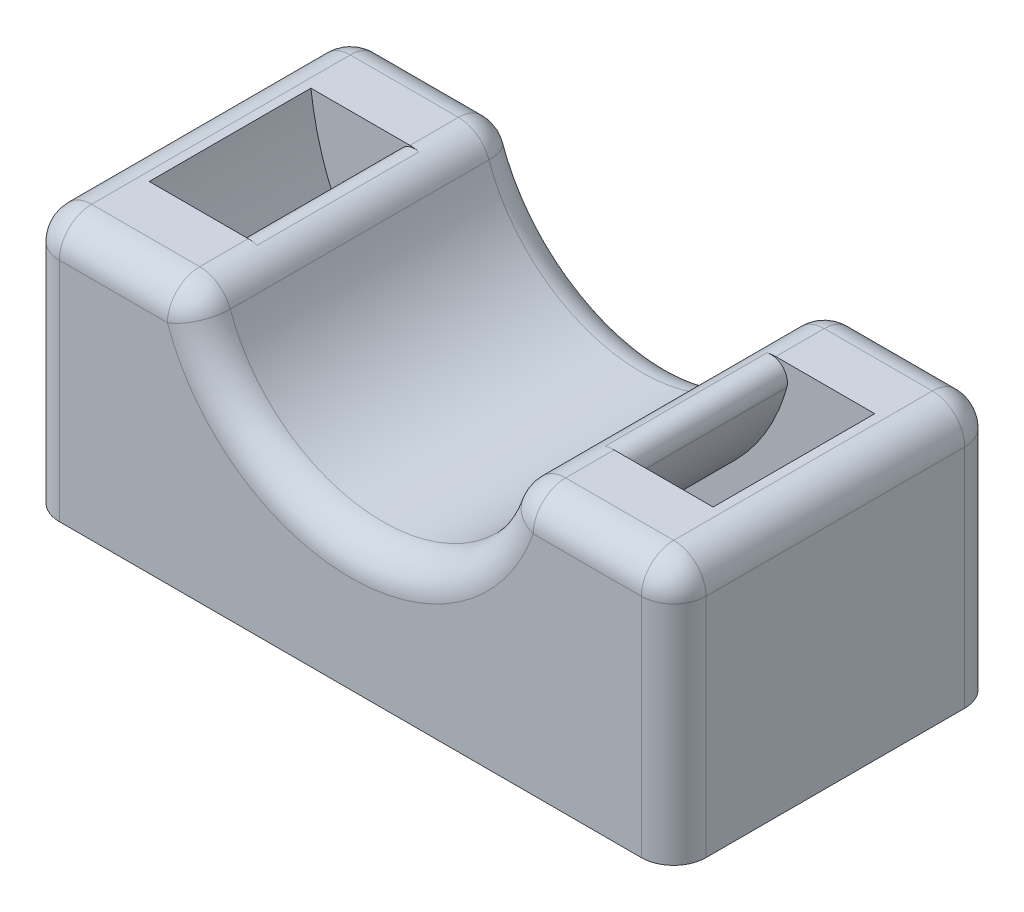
ISO-10303-21;
HEADER;
FILE_DESCRIPTION(('STEP AP214'),'2;1');
FILE_NAME('part.step','',(''),(''),'','','');
FILE_SCHEMA(('AUTOMOTIVE_DESIGN { 1 0 10303 214 1 1 1 1 }'));
ENDSEC;
DATA;
#1=APPLICATION_CONTEXT('core data for automotive mechanical design processes');
#2=APPLICATION_PROTOCOL_DEFINITION('international standard','automotive_design',2000,#1);
#3=PRODUCT_CONTEXT('',#1,'mechanical');
#4=PRODUCT('Part','Part','',(#3));
#5=PRODUCT_RELATED_PRODUCT_CATEGORY('part','',(#4));
#6=PRODUCT_DEFINITION_FORMATION('','',#4);
#7=PRODUCT_DEFINITION_CONTEXT('part definition',#1,'design');
#8=PRODUCT_DEFINITION('design','',#6,#7);
#9=PRODUCT_DEFINITION_SHAPE('','',#8);
#10=(LENGTH_UNIT() NAMED_UNIT(*) SI_UNIT(.MILLI.,.METRE.));
#11=(NAMED_UNIT(*) PLANE_ANGLE_UNIT() SI_UNIT($,.RADIAN.));
#12=(NAMED_UNIT(*) SI_UNIT($,.STERADIAN.) SOLID_ANGLE_UNIT());
#13=UNCERTAINTY_MEASURE_WITH_UNIT(LENGTH_MEASURE(1.E-05),#10,'distance_accuracy_value','');
#14=(GEOMETRIC_REPRESENTATION_CONTEXT(3) GLOBAL_UNCERTAINTY_ASSIGNED_CONTEXT((#13)) GLOBAL_UNIT_ASSIGNED_CONTEXT((#10,
#11,#12)) REPRESENTATION_CONTEXT('',''));
#15=CARTESIAN_POINT('',(0.,0.,0.));
#16=DIRECTION('',(0.,0.,1.));
#17=DIRECTION('',(1.,0.,0.));
#18=AXIS2_PLACEMENT_3D('',#15,#16,#17);
#19=CARTESIAN_POINT('',(0.,9.,0.));
#20=DIRECTION('',(1.,0.,0.));
#21=DIRECTION('',(0.,0.,-1.));
#22=AXIS2_PLACEMENT_3D('',#19,#20,#21);
#23=PLANE('',#22);
#24=DIRECTION('',(0.,0.,1.));
#25=VECTOR('',#24,1.);
#26=CARTESIAN_POINT('',(0.,0.,0.));
#27=LINE('',#26,#25);
#28=CARTESIAN_POINT('',(0.,0.,-9.));
#29=VERTEX_POINT('',#28);
#30=CARTESIAN_POINT('',(0.,0.,-1.));
#31=VERTEX_POINT('',#30);
#32=EDGE_CURVE('E555',#29,#31,#27,.T.);
#33=ORIENTED_EDGE('',*,*,#32,.T.);
#34=DIRECTION('',(0.,-1.,0.));
#35=VECTOR('',#34,1.);
#36=CARTESIAN_POINT('',(0.,9.,-1.));
#37=LINE('',#36,#35);
#38=CARTESIAN_POINT('',(0.,7.,-1.));
#39=VERTEX_POINT('',#38);
#40=EDGE_CURVE('E520',#31,#39,#37,.F.);
#41=ORIENTED_EDGE('',*,*,#40,.T.);
#42=DIRECTION('',(0.,0.,1.));
#43=VECTOR('',#42,1.);
#44=CARTESIAN_POINT('',(0.,7.,-10.));
#45=LINE('',#44,#43);
#46=CARTESIAN_POINT('',(0.,7.,-9.));
#47=VERTEX_POINT('',#46);
#48=EDGE_CURVE('E525',#39,#47,#45,.F.);
#49=ORIENTED_EDGE('',*,*,#48,.T.);
#50=DIRECTION('',(0.,-1.,0.));
#51=VECTOR('',#50,1.);
#52=CARTESIAN_POINT('',(0.,9.,-9.));
#53=LINE('',#52,#51);
#54=EDGE_CURVE('E510',#47,#29,#53,.T.);
#55=ORIENTED_EDGE('',*,*,#54,.T.);
#56=EDGE_LOOP('',(#33,#41,#49,#55));
#57=FACE_BOUND('',#56,.T.);
#58=ADVANCED_FACE('F35',(#57),#23,.F.);
#59=CARTESIAN_POINT('',(0.,9.,0.));
#60=DIRECTION('',(0.,0.,-1.));
#61=DIRECTION('',(-1.,0.,0.));
#62=AXIS2_PLACEMENT_3D('',#59,#60,#61);
#63=PLANE('',#62);
#64=DIRECTION('',(1.,0.,0.));
#65=VECTOR('',#64,1.);
#66=CARTESIAN_POINT('',(0.,7.,0.));
#67=LINE('',#66,#65);
#68=CARTESIAN_POINT('',(4.34314575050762,7.,0.));
#69=VERTEX_POINT('',#68);
#70=CARTESIAN_POINT('',(1.,7.,0.));
#71=VERTEX_POINT('',#70);
#72=EDGE_CURVE('E538',#69,#71,#67,.F.);
#73=ORIENTED_EDGE('',*,*,#72,.T.);
#74=DIRECTION('',(0.,-1.,0.));
#75=VECTOR('',#74,1.);
#76=CARTESIAN_POINT('',(1.,9.,0.));
#77=LINE('',#76,#75);
#78=CARTESIAN_POINT('',(1.,0.,0.));
#79=VERTEX_POINT('',#78);
#80=EDGE_CURVE('E535',#71,#79,#77,.T.);
#81=ORIENTED_EDGE('',*,*,#80,.T.);
#82=DIRECTION('',(1.,0.,0.));
#83=VECTOR('',#82,1.);
#84=CARTESIAN_POINT('',(0.,0.,0.));
#85=LINE('',#84,#83);
#86=CARTESIAN_POINT('',(19.,0.,0.));
#87=VERTEX_POINT('',#86);
#88=EDGE_CURVE('E561',#79,#87,#85,.T.);
#89=ORIENTED_EDGE('',*,*,#88,.T.);
#90=DIRECTION('',(0.,-1.,0.));
#91=VECTOR('',#90,1.);
#92=CARTESIAN_POINT('',(19.,9.,0.));
#93=LINE('',#92,#91);
#94=CARTESIAN_POINT('',(19.,7.,0.));
#95=VERTEX_POINT('',#94);
#96=EDGE_CURVE('E543',#87,#95,#93,.F.);
#97=ORIENTED_EDGE('',*,*,#96,.T.);
#98=DIRECTION('',(1.,0.,0.));
#99=VECTOR('',#98,1.);
#100=CARTESIAN_POINT('',(14.8989794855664,7.,0.));
#101=LINE('',#100,#99);
#102=CARTESIAN_POINT('',(15.6568542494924,7.,0.));
#103=VERTEX_POINT('',#102);
#104=EDGE_CURVE('E541',#95,#103,#101,.F.);
#105=ORIENTED_EDGE('',*,*,#104,.T.);
#106=CARTESIAN_POINT('',(10.,9.,0.));
#107=DIRECTION('',(0.,0.,-1.));
#108=DIRECTION('',(-1.,0.,0.));
#109=AXIS2_PLACEMENT_3D('',#106,#107,#108);
#110=CIRCLE('',#109,6.);
#111=EDGE_CURVE('E470',#103,#69,#110,.T.);
#112=ORIENTED_EDGE('',*,*,#111,.T.);
#113=EDGE_LOOP('',(#73,#81,#89,#97,#105,#112));
#114=FACE_BOUND('',#113,.T.);
#115=ADVANCED_FACE('F630',(#114),#63,.F.);
#116=CARTESIAN_POINT('',(20.,9.,0.));
#117=DIRECTION('',(-1.,0.,0.));
#118=DIRECTION('',(0.,0.,1.));
#119=AXIS2_PLACEMENT_3D('',#116,#117,#118);
#120=PLANE('',#119);
#121=DIRECTION('',(0.,0.,-1.));
#122=VECTOR('',#121,1.);
#123=CARTESIAN_POINT('',(20.,7.,0.));
#124=LINE('',#123,#122);
#125=CARTESIAN_POINT('',(20.,7.,-9.));
#126=VERTEX_POINT('',#125);
#127=CARTESIAN_POINT('',(20.,7.,-1.));
#128=VERTEX_POINT('',#127);
#129=EDGE_CURVE('E456',#126,#128,#124,.F.);
#130=ORIENTED_EDGE('',*,*,#129,.T.);
#131=DIRECTION('',(0.,-1.,0.));
#132=VECTOR('',#131,1.);
#133=CARTESIAN_POINT('',(20.,9.,-1.));
#134=LINE('',#133,#132);
#135=CARTESIAN_POINT('',(20.,0.,-1.));
#136=VERTEX_POINT('',#135);
#137=EDGE_CURVE('E487',#128,#136,#134,.T.);
#138=ORIENTED_EDGE('',*,*,#137,.T.);
#139=DIRECTION('',(0.,0.,-1.));
#140=VECTOR('',#139,1.);
#141=CARTESIAN_POINT('',(20.,0.,0.));
#142=LINE('',#141,#140);
#143=CARTESIAN_POINT('',(20.,0.,-9.));
#144=VERTEX_POINT('',#143);
#145=EDGE_CURVE('E564',#136,#144,#142,.T.);
#146=ORIENTED_EDGE('',*,*,#145,.T.);
#147=DIRECTION('',(0.,-1.,0.));
#148=VECTOR('',#147,1.);
#149=CARTESIAN_POINT('',(20.,9.,-9.));
#150=LINE('',#149,#148);
#151=EDGE_CURVE('E485',#144,#126,#150,.F.);
#152=ORIENTED_EDGE('',*,*,#151,.T.);
#153=EDGE_LOOP('',(#130,#138,#146,#152));
#154=FACE_BOUND('',#153,.T.);
#155=ADVANCED_FACE('F660',(#154),#120,.F.);
#156=CARTESIAN_POINT('',(0.,9.,-10.));
#157=DIRECTION('',(0.,0.,1.));
#158=DIRECTION('',(1.,0.,0.));
#159=AXIS2_PLACEMENT_3D('',#156,#157,#158);
#160=PLANE('',#159);
#161=DIRECTION('',(-1.,0.,0.));
#162=VECTOR('',#161,1.);
#163=CARTESIAN_POINT('',(5.10102051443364,7.,-10.));
#164=LINE('',#163,#162);
#165=CARTESIAN_POINT('',(1.,7.,-10.));
#166=VERTEX_POINT('',#165);
#167=CARTESIAN_POINT('',(4.34314575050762,7.,-10.));
#168=VERTEX_POINT('',#167);
#169=EDGE_CURVE('E492',#166,#168,#164,.F.);
#170=ORIENTED_EDGE('',*,*,#169,.T.);
#171=CARTESIAN_POINT('',(10.,9.,-10.));
#172=DIRECTION('',(0.,0.,1.));
#173=DIRECTION('',(1.,0.,0.));
#174=AXIS2_PLACEMENT_3D('',#171,#172,#173);
#175=CIRCLE('',#174,6.);
#176=CARTESIAN_POINT('',(15.6568542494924,7.,-10.));
#177=VERTEX_POINT('',#176);
#178=EDGE_CURVE('E351',#168,#177,#175,.T.);
#179=ORIENTED_EDGE('',*,*,#178,.T.);
#180=DIRECTION('',(-1.,0.,0.));
#181=VECTOR('',#180,1.);
#182=CARTESIAN_POINT('',(20.,7.,-10.));
#183=LINE('',#182,#181);
#184=CARTESIAN_POINT('',(19.,7.,-10.));
#185=VERTEX_POINT('',#184);
#186=EDGE_CURVE('E489',#177,#185,#183,.F.);
#187=ORIENTED_EDGE('',*,*,#186,.T.);
#188=DIRECTION('',(0.,-1.,0.));
#189=VECTOR('',#188,1.);
#190=CARTESIAN_POINT('',(19.,9.,-10.));
#191=LINE('',#190,#189);
#192=CARTESIAN_POINT('',(19.,0.,-10.));
#193=VERTEX_POINT('',#192);
#194=EDGE_CURVE('E491',#185,#193,#191,.T.);
#195=ORIENTED_EDGE('',*,*,#194,.T.);
#196=DIRECTION('',(-1.,0.,0.));
#197=VECTOR('',#196,1.);
#198=CARTESIAN_POINT('',(0.,0.,-10.));
#199=LINE('',#198,#197);
#200=CARTESIAN_POINT('',(1.,0.,-10.));
#201=VERTEX_POINT('',#200);
#202=EDGE_CURVE('E498',#193,#201,#199,.T.);
#203=ORIENTED_EDGE('',*,*,#202,.T.);
#204=DIRECTION('',(0.,-1.,0.));
#205=VECTOR('',#204,1.);
#206=CARTESIAN_POINT('',(1.,9.,-10.));
#207=LINE('',#206,#205);
#208=EDGE_CURVE('E393',#201,#166,#207,.F.);
#209=ORIENTED_EDGE('',*,*,#208,.T.);
#210=EDGE_LOOP('',(#170,#179,#187,#195,#203,#209));
#211=FACE_BOUND('',#210,.T.);
#212=ADVANCED_FACE('F496',(#211),#160,.F.);
#213=CARTESIAN_POINT('',(10.,9.,-10.));
#214=DIRECTION('',(0.,0.,1.));
#215=DIRECTION('',(1.,0.,0.));
#216=AXIS2_PLACEMENT_3D('',#213,#214,#215);
#217=CYLINDRICAL_SURFACE('',#216,5.);
#218=CARTESIAN_POINT('',(10.,9.,-9.));
#219=DIRECTION('',(0.,0.,1.));
#220=DIRECTION('',(1.,0.,0.));
#221=AXIS2_PLACEMENT_3D('',#218,#219,#220);
#222=CIRCLE('',#221,5.);
#223=CARTESIAN_POINT('',(14.7140452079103,7.33333333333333,-9.));
#224=VERTEX_POINT('',#223);
#225=CARTESIAN_POINT('',(5.28595479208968,7.33333333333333,-9.));
#226=VERTEX_POINT('',#225);
#227=EDGE_CURVE('E433',#224,#226,#222,.F.);
#228=ORIENTED_EDGE('',*,*,#227,.T.);
#229=DIRECTION('',(0.,0.,1.));
#230=VECTOR('',#229,1.);
#231=CARTESIAN_POINT('',(5.28595479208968,7.33333333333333,-10.));
#232=LINE('',#231,#230);
#233=CARTESIAN_POINT('',(5.28595479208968,7.33333333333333,-0.999999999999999));
#234=VERTEX_POINT('',#233);
#235=EDGE_CURVE('E437',#226,#234,#232,.T.);
#236=ORIENTED_EDGE('',*,*,#235,.T.);
#237=CARTESIAN_POINT('',(10.,9.,-0.999999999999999));
#238=DIRECTION('',(0.,0.,-1.));
#239=DIRECTION('',(-1.,0.,0.));
#240=AXIS2_PLACEMENT_3D('',#237,#238,#239);
#241=CIRCLE('',#240,5.);
#242=CARTESIAN_POINT('',(14.7140452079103,7.33333333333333,-0.999999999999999));
#243=VERTEX_POINT('',#242);
#244=EDGE_CURVE('E467',#234,#243,#241,.F.);
#245=ORIENTED_EDGE('',*,*,#244,.T.);
#246=DIRECTION('',(0.,0.,1.));
#247=VECTOR('',#246,1.);
#248=CARTESIAN_POINT('',(14.7140452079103,7.33333333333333,-10.));
#249=LINE('',#248,#247);
#250=EDGE_CURVE('E435',#243,#224,#249,.F.);
#251=ORIENTED_EDGE('',*,*,#250,.T.);
#252=EDGE_LOOP('',(#228,#236,#245,#251));
#253=FACE_BOUND('',#252,.T.);
#254=ADVANCED_FACE('F472',(#253),#217,.F.);
#255=CARTESIAN_POINT('',(0.,0.,0.));
#256=DIRECTION('',(0.,-1.,0.));
#257=DIRECTION('',(0.,0.,-1.));
#258=AXIS2_PLACEMENT_3D('',#255,#256,#257);
#259=PLANE('',#258);
#260=ORIENTED_EDGE('',*,*,#88,.F.);
#261=CARTESIAN_POINT('',(1.,0.,-1.));
#262=DIRECTION('',(0.,-1.,0.));
#263=DIRECTION('',(0.,0.,-1.));
#264=AXIS2_PLACEMENT_3D('',#261,#262,#263);
#265=CIRCLE('',#264,1.);
#266=EDGE_CURVE('E527',#79,#31,#265,.T.);
#267=ORIENTED_EDGE('',*,*,#266,.T.);
#268=ORIENTED_EDGE('',*,*,#32,.F.);
#269=CARTESIAN_POINT('',(1.,0.,-9.));
#270=DIRECTION('',(0.,-1.,0.));
#271=DIRECTION('',(0.,0.,-1.));
#272=AXIS2_PLACEMENT_3D('',#269,#270,#271);
#273=CIRCLE('',#272,1.);
#274=EDGE_CURVE('E533',#29,#201,#273,.T.);
#275=ORIENTED_EDGE('',*,*,#274,.T.);
#276=ORIENTED_EDGE('',*,*,#202,.F.);
#277=CARTESIAN_POINT('',(19.,0.,-9.));
#278=DIRECTION('',(0.,-1.,0.));
#279=DIRECTION('',(0.,0.,-1.));
#280=AXIS2_PLACEMENT_3D('',#277,#278,#279);
#281=CIRCLE('',#280,1.);
#282=EDGE_CURVE('E531',#193,#144,#281,.T.);
#283=ORIENTED_EDGE('',*,*,#282,.T.);
#284=ORIENTED_EDGE('',*,*,#145,.F.);
#285=CARTESIAN_POINT('',(19.,0.,-1.));
#286=DIRECTION('',(0.,-1.,0.));
#287=DIRECTION('',(0.,0.,-1.));
#288=AXIS2_PLACEMENT_3D('',#285,#286,#287);
#289=CIRCLE('',#288,1.);
#290=EDGE_CURVE('E529',#136,#87,#289,.T.);
#291=ORIENTED_EDGE('',*,*,#290,.T.);
#292=EDGE_LOOP('',(#260,#267,#268,#275,#276,#283,#284,#291));
#293=FACE_BOUND('',#292,.T.);
#294=ADVANCED_FACE('F654',(#293),#259,.T.);
#295=CARTESIAN_POINT('',(0.,8.,0.));
#296=DIRECTION('',(0.,1.,0.));
#297=DIRECTION('',(0.,0.,1.));
#298=AXIS2_PLACEMENT_3D('',#295,#296,#297);
#299=PLANE('',#298);
#300=DIRECTION('',(1.,0.,0.));
#301=VECTOR('',#300,1.);
#302=CARTESIAN_POINT('',(3.81841017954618,8.,-7.5));
#303=LINE('',#302,#301);
#304=CARTESIAN_POINT('',(4.34314575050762,8.,-7.5));
#305=VERTEX_POINT('',#304);
#306=CARTESIAN_POINT('',(1.28037585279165,7.99999799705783,-7.5));
#307=VERTEX_POINT('',#306);
#308=EDGE_CURVE('E53',#305,#307,#303,.F.);
#309=ORIENTED_EDGE('',*,*,#308,.F.);
#310=DIRECTION('',(0.,0.,-1.));
#311=VECTOR('',#310,1.);
#312=CARTESIAN_POINT('',(4.34314575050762,8.,-9.));
#313=LINE('',#312,#311);
#314=CARTESIAN_POINT('',(4.34314575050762,8.,-9.));
#315=VERTEX_POINT('',#314);
#316=EDGE_CURVE('E431',#305,#315,#313,.T.);
#317=ORIENTED_EDGE('',*,*,#316,.T.);
#318=DIRECTION('',(-1.,0.,0.));
#319=VECTOR('',#318,1.);
#320=CARTESIAN_POINT('',(0.,8.,-9.));
#321=LINE('',#320,#319);
#322=CARTESIAN_POINT('',(1.,8.,-9.));
#323=VERTEX_POINT('',#322);
#324=EDGE_CURVE('E479',#315,#323,#321,.T.);
#325=ORIENTED_EDGE('',*,*,#324,.T.);
#326=DIRECTION('',(0.,0.,1.));
#327=VECTOR('',#326,1.);
#328=CARTESIAN_POINT('',(1.,8.,0.));
#329=LINE('',#328,#327);
#330=CARTESIAN_POINT('',(1.,8.,-1.));
#331=VERTEX_POINT('',#330);
#332=EDGE_CURVE('E517',#323,#331,#329,.T.);
#333=ORIENTED_EDGE('',*,*,#332,.T.);
#334=DIRECTION('',(1.,0.,0.));
#335=VECTOR('',#334,1.);
#336=CARTESIAN_POINT('',(5.10102051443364,8.,-1.));
#337=LINE('',#336,#335);
#338=CARTESIAN_POINT('',(4.34314575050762,8.,-1.));
#339=VERTEX_POINT('',#338);
#340=EDGE_CURVE('E476',#331,#339,#337,.T.);
#341=ORIENTED_EDGE('',*,*,#340,.T.);
#342=CARTESIAN_POINT('',(4.34314575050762,8.,-2.5));
#343=VERTEX_POINT('',#342);
#344=EDGE_CURVE('E202',#339,#343,#313,.T.);
#345=ORIENTED_EDGE('',*,*,#344,.T.);
#346=DIRECTION('',(1.,0.,0.));
#347=VECTOR('',#346,1.);
#348=CARTESIAN_POINT('',(3.81841017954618,8.,-2.5));
#349=LINE('',#348,#347);
#350=CARTESIAN_POINT('',(1.28036048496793,7.99999576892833,-2.5));
#351=VERTEX_POINT('',#350);
#352=EDGE_CURVE('E196',#351,#343,#349,.T.);
#353=ORIENTED_EDGE('',*,*,#352,.F.);
#354=DIRECTION('',(0.,0.,1.));
#355=VECTOR('',#354,1.);
#356=CARTESIAN_POINT('',(1.28032297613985,8.,-5.));
#357=LINE('',#356,#355);
#358=EDGE_CURVE('E199',#307,#351,#357,.T.);
#359=ORIENTED_EDGE('',*,*,#358,.F.);
#360=EDGE_LOOP('',(#309,#317,#325,#333,#341,#345,#353,#359));
#361=FACE_BOUND('',#360,.T.);
#362=ADVANCED_FACE('F198',(#361),#299,.T.);
#363=CARTESIAN_POINT('',(15.6568542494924,8.,-2.5));
#364=VERTEX_POINT('',#363);
#365=CARTESIAN_POINT('',(18.7192769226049,8.00000004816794,-2.5));
#366=VERTEX_POINT('',#365);
#367=EDGE_CURVE('E61',#364,#366,#349,.T.);
#368=ORIENTED_EDGE('',*,*,#367,.F.);
#369=DIRECTION('',(0.,0.,-1.));
#370=VECTOR('',#369,1.);
#371=CARTESIAN_POINT('',(15.6568542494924,8.,-0.999999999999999));
#372=LINE('',#371,#370);
#373=CARTESIAN_POINT('',(15.6568542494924,8.,-1.));
#374=VERTEX_POINT('',#373);
#375=EDGE_CURVE('E442',#364,#374,#372,.F.);
#376=ORIENTED_EDGE('',*,*,#375,.T.);
#377=DIRECTION('',(1.,0.,0.));
#378=VECTOR('',#377,1.);
#379=CARTESIAN_POINT('',(20.,8.,-1.));
#380=LINE('',#379,#378);
#381=CARTESIAN_POINT('',(19.,8.,-1.));
#382=VERTEX_POINT('',#381);
#383=EDGE_CURVE('E448',#374,#382,#380,.T.);
#384=ORIENTED_EDGE('',*,*,#383,.T.);
#385=DIRECTION('',(0.,0.,-1.));
#386=VECTOR('',#385,1.);
#387=CARTESIAN_POINT('',(19.,8.,-10.));
#388=LINE('',#387,#386);
#389=CARTESIAN_POINT('',(19.,8.,-9.));
#390=VERTEX_POINT('',#389);
#391=EDGE_CURVE('E475',#382,#390,#388,.T.);
#392=ORIENTED_EDGE('',*,*,#391,.T.);
#393=DIRECTION('',(-1.,0.,0.));
#394=VECTOR('',#393,1.);
#395=CARTESIAN_POINT('',(14.8989794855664,8.,-9.));
#396=LINE('',#395,#394);
#397=CARTESIAN_POINT('',(15.6568542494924,8.,-9.));
#398=VERTEX_POINT('',#397);
#399=EDGE_CURVE('E457',#390,#398,#396,.T.);
#400=ORIENTED_EDGE('',*,*,#399,.T.);
#401=CARTESIAN_POINT('',(15.6568542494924,8.,-7.5));
#402=VERTEX_POINT('',#401);
#403=EDGE_CURVE('E358',#398,#402,#372,.F.);
#404=ORIENTED_EDGE('',*,*,#403,.T.);
#405=CARTESIAN_POINT('',(18.7192868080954,8.00000245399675,-7.5));
#406=VERTEX_POINT('',#405);
#407=EDGE_CURVE('E544',#406,#402,#303,.F.);
#408=ORIENTED_EDGE('',*,*,#407,.F.);
#409=DIRECTION('',(0.,0.,1.));
#410=VECTOR('',#409,1.);
#411=CARTESIAN_POINT('',(18.7192217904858,8.,-5.));
#412=LINE('',#411,#410);
#413=EDGE_CURVE('E316',#366,#406,#412,.F.);
#414=ORIENTED_EDGE('',*,*,#413,.F.);
#415=EDGE_LOOP('',(#368,#376,#384,#392,#400,#404,#408,#414));
#416=FACE_BOUND('',#415,.T.);
#417=ADVANCED_FACE('F447',(#416),#299,.T.);
#418=CARTESIAN_POINT('',(3.81841017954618,10.0000000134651,-7.5));
#419=DIRECTION('',(0.,0.,-1.));
#420=DIRECTION('',(-1.,0.,0.));
#421=AXIS2_PLACEMENT_3D('',#418,#419,#420);
#422=PLANE('',#421);
#423=CARTESIAN_POINT('',(1.26916036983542,10.1336005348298,-7.5));
#424=CARTESIAN_POINT('',(1.25434738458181,9.85095214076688,-7.5));
#425=CARTESIAN_POINT('',(1.2236306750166,9.48025887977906,-7.5));
#426=CARTESIAN_POINT('',(1.22362053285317,8.46681702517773,-7.5));
#427=CARTESIAN_POINT('',(1.26941135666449,7.93388864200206,-7.5));
#428=CARTESIAN_POINT('',(1.48554504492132,6.79421596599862,-7.5));
#429=CARTESIAN_POINT('',(1.65368482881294,6.20952406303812,-7.5));
#430=CARTESIAN_POINT('',(2.40737984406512,4.4099492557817,-7.5));
#431=CARTESIAN_POINT('',(3.20556846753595,3.23797026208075,-7.5));
#432=CARTESIAN_POINT('',(5.55588896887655,1.27892428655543,-7.5));
#433=CARTESIAN_POINT('',(6.97287186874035,0.608025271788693,-7.5));
#434=CARTESIAN_POINT('',(10.1315064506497,0.0797147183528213,-7.5));
#435=CARTESIAN_POINT('',(11.6614456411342,0.256815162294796,-7.5));
#436=CARTESIAN_POINT('',(14.4302574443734,1.28140713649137,-7.5));
#437=CARTESIAN_POINT('',(15.5351289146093,2.07721986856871,-7.5));
#438=CARTESIAN_POINT('',(17.2365217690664,3.88185365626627,-7.5));
#439=CARTESIAN_POINT('',(17.803557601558,4.86133721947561,-7.5));
#440=CARTESIAN_POINT('',(18.5344086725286,6.72229078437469,-7.5));
#441=CARTESIAN_POINT('',(18.7047406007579,7.62086155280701,-7.5));
#442=CARTESIAN_POINT('',(18.8103231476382,9.22956745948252,-7.5));
#443=CARTESIAN_POINT('',(18.7456979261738,9.85008752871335,-7.5));
#444=CARTESIAN_POINT('',(18.7308396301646,10.1336005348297,-7.5));
#445=B_SPLINE_CURVE_WITH_KNOTS('',3,(#423,#424,#425,#426,#427,#428,#429,#430,#431,#432,#433,
#434,#435,#436,#437,#438,#439,#440,#441,#442,#443,#444),.UNSPECIFIED.,.F.,.F.,(4,2,2,2,2,2,2,2,
2,2,4),(0.,0.0532958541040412,0.112464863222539,0.171633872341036,0.289971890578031,
0.408309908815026,0.526647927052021,0.644985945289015,0.76332396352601,0.881661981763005,1.),.UNSPECIFIED.);
#446=EDGE_CURVE('E216',#307,#406,#445,.T.);
#447=ORIENTED_EDGE('',*,*,#446,.T.);
#448=ORIENTED_EDGE('',*,*,#407,.T.);
#449=CARTESIAN_POINT('',(15.6568542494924,7.,-7.5));
#450=DIRECTION('',(0.,0.,-1.));
#451=DIRECTION('',(-1.,0.,0.));
#452=AXIS2_PLACEMENT_3D('',#449,#450,#451);
#453=CIRCLE('',#452,1.);
#454=CARTESIAN_POINT('',(15.3799900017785,7.9609090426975,-7.5));
#455=VERTEX_POINT('',#454);
#456=EDGE_CURVE('E344',#455,#402,#453,.T.);
#457=ORIENTED_EDGE('',*,*,#456,.F.);
#458=CARTESIAN_POINT('',(15.5184221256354,7.48045452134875,-7.5));
#459=DIRECTION('',(0.,0.,-1.));
#460=DIRECTION('',(-1.,0.,0.));
#461=AXIS2_PLACEMENT_3D('',#458,#459,#460);
#462=CIRCLE('',#461,0.5);
#463=CARTESIAN_POINT('',(16.0006316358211,7.34753208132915,-7.5));
#464=VERTEX_POINT('',#463);
#465=EDGE_CURVE('E322',#455,#464,#462,.T.);
#466=ORIENTED_EDGE('',*,*,#465,.T.);
#467=CARTESIAN_POINT('',(3.81841017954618,10.0000000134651,-7.5));
#468=CARTESIAN_POINT('',(3.8026483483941,9.69924666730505,-7.5));
#469=CARTESIAN_POINT('',(3.77637693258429,9.33466301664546,-7.5));
#470=CARTESIAN_POINT('',(3.77637102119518,8.62845742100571,-7.5));
#471=CARTESIAN_POINT('',(3.80887705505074,8.24384792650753,-7.5));
#472=CARTESIAN_POINT('',(3.96216986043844,7.43553514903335,-7.5));
#473=CARTESIAN_POINT('',(4.08224354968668,7.01903037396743,-7.5));
#474=CARTESIAN_POINT('',(4.61401448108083,5.74933481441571,-7.5));
#475=CARTESIAN_POINT('',(5.19074522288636,4.90652399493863,-7.5));
#476=CARTESIAN_POINT('',(6.83962139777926,3.53214661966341,-7.5));
#477=CARTESIAN_POINT('',(7.86697876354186,3.04668690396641,-7.5));
#478=CARTESIAN_POINT('',(10.0796372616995,2.67659977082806,-7.5));
#479=CARTESIAN_POINT('',(11.1869625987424,2.80315630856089,-7.5));
#480=CARTESIAN_POINT('',(13.1328715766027,3.52323634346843,-7.5));
#481=CARTESIAN_POINT('',(13.9269306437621,4.09271046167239,-7.5));
#482=CARTESIAN_POINT('',(15.1298819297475,5.36865839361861,-7.5));
#483=CARTESIAN_POINT('',(15.5331892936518,6.06365789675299,-7.5));
#484=CARTESIAN_POINT('',(16.0526191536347,7.38627414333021,-7.5));
#485=CARTESIAN_POINT('',(16.1727400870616,8.02066692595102,-7.5));
#486=CARTESIAN_POINT('',(16.2477882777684,9.16413312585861,-7.5));
#487=CARTESIAN_POINT('',(16.2010007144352,9.6296186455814,-7.5));
#488=CARTESIAN_POINT('',(16.1815898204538,10.0000000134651,-7.5));
#489=B_SPLINE_CURVE_WITH_KNOTS('',3,(#467,#468,#469,#470,#471,#472,#473,#474,#475,#476,#477,
#478,#479,#480,#481,#482,#483,#484,#485,#486,#487,#488),.UNSPECIFIED.,.F.,.F.,(4,2,2,2,2,2,2,2,
2,2,4),(0.,0.0532958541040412,0.112464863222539,0.171633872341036,0.289971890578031,
0.408309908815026,0.526647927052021,0.644985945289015,0.76332396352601,0.881661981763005,1.),.UNSPECIFIED.);
#490=CARTESIAN_POINT('',(3.99950869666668,7.34773439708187,-7.5));
#491=VERTEX_POINT('',#490);
#492=EDGE_CURVE('E291',#491,#464,#489,.T.);
#493=ORIENTED_EDGE('',*,*,#492,.F.);
#494=CARTESIAN_POINT('',(4.48168221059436,7.4804244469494,-7.5));
#495=DIRECTION('',(0.,0.,-1.));
#496=DIRECTION('',(-1.,0.,0.));
#497=AXIS2_PLACEMENT_3D('',#494,#495,#496);
#498=CIRCLE('',#497,0.5);
#499=CARTESIAN_POINT('',(4.62021867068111,7.96084889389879,-7.5));
#500=VERTEX_POINT('',#499);
#501=EDGE_CURVE('E45',#491,#500,#498,.T.);
#502=ORIENTED_EDGE('',*,*,#501,.T.);
#503=CARTESIAN_POINT('',(4.34314575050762,7.,-7.5));
#504=DIRECTION('',(0.,0.,-1.));
#505=DIRECTION('',(-1.,0.,0.));
#506=AXIS2_PLACEMENT_3D('',#503,#504,#505);
#507=CIRCLE('',#506,1.);
#508=EDGE_CURVE('E330',#305,#500,#507,.T.);
#509=ORIENTED_EDGE('',*,*,#508,.F.);
#510=ORIENTED_EDGE('',*,*,#308,.T.);
#511=EDGE_LOOP('',(#447,#448,#457,#466,#493,#502,#509,#510));
#512=FACE_BOUND('',#511,.T.);
#513=ADVANCED_FACE('F258',(#512),#422,.F.);
#514=CARTESIAN_POINT('',(3.81841017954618,10.0000000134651,-2.5));
#515=CARTESIAN_POINT('',(3.80264834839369,9.69924666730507,-2.5));
#516=CARTESIAN_POINT('',(3.77637693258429,9.33466301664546,-2.5));
#517=CARTESIAN_POINT('',(3.77637102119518,8.62845742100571,-2.5));
#518=CARTESIAN_POINT('',(3.80887705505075,8.24384792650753,-2.5));
#519=CARTESIAN_POINT('',(3.96216986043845,7.43553514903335,-2.5));
#520=CARTESIAN_POINT('',(4.08224354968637,7.01903037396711,-2.5));
#521=CARTESIAN_POINT('',(4.61401448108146,5.74933481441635,-2.5));
#522=CARTESIAN_POINT('',(5.19074522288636,4.90652399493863,-2.5));
#523=CARTESIAN_POINT('',(6.83962139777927,3.53214661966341,-2.5));
#524=CARTESIAN_POINT('',(7.86697876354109,3.04668690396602,-2.5));
#525=CARTESIAN_POINT('',(10.0796372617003,2.67659977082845,-2.5));
#526=CARTESIAN_POINT('',(11.1869625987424,2.80315630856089,-2.5));
#527=CARTESIAN_POINT('',(13.1328715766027,3.52323634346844,-2.5));
#528=CARTESIAN_POINT('',(13.9269306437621,4.09271046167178,-2.5));
#529=CARTESIAN_POINT('',(15.1298819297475,5.36865839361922,-2.5));
#530=CARTESIAN_POINT('',(15.5331892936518,6.06365789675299,-2.5));
#531=CARTESIAN_POINT('',(16.0526191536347,7.38627414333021,-2.5));
#532=CARTESIAN_POINT('',(16.1727400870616,8.02066692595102,-2.5));
#533=CARTESIAN_POINT('',(16.2477882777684,9.16413312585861,-2.5));
#534=CARTESIAN_POINT('',(16.2010007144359,9.62961864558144,-2.5));
#535=CARTESIAN_POINT('',(16.1815898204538,10.0000000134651,-2.5));
#536=CARTESIAN_POINT('',(3.81841017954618,10.0000000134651,-7.5));
#537=CARTESIAN_POINT('',(3.8026483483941,9.69924666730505,-7.5));
#538=CARTESIAN_POINT('',(3.77637693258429,9.33466301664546,-7.5));
#539=CARTESIAN_POINT('',(3.77637102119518,8.62845742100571,-7.5));
#540=CARTESIAN_POINT('',(3.80887705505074,8.24384792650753,-7.5));
#541=CARTESIAN_POINT('',(3.96216986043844,7.43553514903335,-7.5));
#542=CARTESIAN_POINT('',(4.08224354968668,7.01903037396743,-7.5));
#543=CARTESIAN_POINT('',(4.61401448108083,5.74933481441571,-7.5));
#544=CARTESIAN_POINT('',(5.19074522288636,4.90652399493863,-7.5));
#545=CARTESIAN_POINT('',(6.83962139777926,3.53214661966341,-7.5));
#546=CARTESIAN_POINT('',(7.86697876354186,3.04668690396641,-7.5));
#547=CARTESIAN_POINT('',(10.0796372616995,2.67659977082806,-7.5));
#548=CARTESIAN_POINT('',(11.1869625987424,2.80315630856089,-7.5));
#549=CARTESIAN_POINT('',(13.1328715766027,3.52323634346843,-7.5));
#550=CARTESIAN_POINT('',(13.9269306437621,4.09271046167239,-7.5));
#551=CARTESIAN_POINT('',(15.1298819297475,5.36865839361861,-7.5));
#552=CARTESIAN_POINT('',(15.5331892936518,6.06365789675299,-7.5));
#553=CARTESIAN_POINT('',(16.0526191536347,7.38627414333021,-7.5));
#554=CARTESIAN_POINT('',(16.1727400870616,8.02066692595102,-7.5));
#555=CARTESIAN_POINT('',(16.2477882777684,9.16413312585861,-7.5));
#556=CARTESIAN_POINT('',(16.2010007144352,9.6296186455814,-7.5));
#557=CARTESIAN_POINT('',(16.1815898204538,10.0000000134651,-7.5));
#558=B_SPLINE_SURFACE_WITH_KNOTS('',1,3,((#514,#515,#516,#517,#518,#519,#520,#521,#522,#523,
#524,#525,#526,#527,#528,#529,#530,#531,#532,#533,#534,#535),(#536,#537,#538,#539,#540,#541,
#542,#543,#544,#545,#546,#547,#548,#549,#550,#551,#552,#553,#554,#555,#556,#557)),.UNSPECIFIED.,
.F.,.F.,.F.,(2,2),(4,2,2,2,2,2,2,2,2,2,4),(0.,1.),(0.,0.0532958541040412,0.112464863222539,
0.171633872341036,0.289971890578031,0.408309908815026,0.526647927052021,0.644985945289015,
0.76332396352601,0.881661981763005,1.),.UNSPECIFIED.);
#559=DIRECTION('',(0.,0.,-1.));
#560=VECTOR('',#559,1.);
#561=CARTESIAN_POINT('',(16.0004442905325,7.34758378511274,-7.5));
#562=LINE('',#561,#560);
#563=CARTESIAN_POINT('',(16.0006430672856,7.34752896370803,-2.5));
#564=VERTEX_POINT('',#563);
#565=EDGE_CURVE('E347',#464,#564,#562,.F.);
#566=CARTESIAN_POINT('',(3.81841017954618,10.0000000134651,-2.5));
#567=CARTESIAN_POINT('',(3.80264834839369,9.69924666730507,-2.5));
#568=CARTESIAN_POINT('',(3.77637693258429,9.33466301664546,-2.5));
#569=CARTESIAN_POINT('',(3.77637102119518,8.62845742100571,-2.5));
#570=CARTESIAN_POINT('',(3.80887705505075,8.24384792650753,-2.5));
#571=CARTESIAN_POINT('',(3.96216986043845,7.43553514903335,-2.5));
#572=CARTESIAN_POINT('',(4.08224354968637,7.01903037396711,-2.5));
#573=CARTESIAN_POINT('',(4.61401448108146,5.74933481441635,-2.5));
#574=CARTESIAN_POINT('',(5.19074522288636,4.90652399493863,-2.5));
#575=CARTESIAN_POINT('',(6.83962139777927,3.53214661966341,-2.5));
#576=CARTESIAN_POINT('',(7.86697876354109,3.04668690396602,-2.5));
#577=CARTESIAN_POINT('',(10.0796372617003,2.67659977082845,-2.5));
#578=CARTESIAN_POINT('',(11.1869625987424,2.80315630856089,-2.5));
#579=CARTESIAN_POINT('',(13.1328715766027,3.52323634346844,-2.5));
#580=CARTESIAN_POINT('',(13.9269306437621,4.09271046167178,-2.5));
#581=CARTESIAN_POINT('',(15.1298819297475,5.36865839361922,-2.5));
#582=CARTESIAN_POINT('',(15.5331892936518,6.06365789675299,-2.5));
#583=CARTESIAN_POINT('',(16.0526191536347,7.38627414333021,-2.5));
#584=CARTESIAN_POINT('',(16.1727400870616,8.02066692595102,-2.5));
#585=CARTESIAN_POINT('',(16.2477882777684,9.16413312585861,-2.5));
#586=CARTESIAN_POINT('',(16.2010007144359,9.62961864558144,-2.5));
#587=CARTESIAN_POINT('',(16.1815898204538,10.0000000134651,-2.5));
#588=B_SPLINE_CURVE_WITH_KNOTS('',3,(#566,#567,#568,#569,#570,#571,#572,#573,#574,#575,#576,
#577,#578,#579,#580,#581,#582,#583,#584,#585,#586,#587),.UNSPECIFIED.,.F.,.F.,(4,2,2,2,2,2,2,2,
2,2,4),(0.,0.0532958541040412,0.112464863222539,0.171633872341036,0.289971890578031,
0.408309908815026,0.526647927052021,0.644985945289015,0.76332396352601,0.881661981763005,1.),.UNSPECIFIED.);
#589=CARTESIAN_POINT('',(3.9994928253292,7.34773010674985,-2.5));
#590=VERTEX_POINT('',#589);
#591=EDGE_CURVE('E39',#590,#564,#588,.T.);
#592=DIRECTION('',(0.,0.,-1.));
#593=VECTOR('',#592,1.);
#594=CARTESIAN_POINT('',(3.99960320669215,7.34776008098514,-2.5));
#595=LINE('',#594,#593);
#596=EDGE_CURVE('E295',#590,#491,#595,.T.);
#597=ORIENTED_EDGE('',*,*,#492,.T.);
#598=ORIENTED_EDGE('',*,*,#565,.T.);
#599=ORIENTED_EDGE('',*,*,#591,.F.);
#600=ORIENTED_EDGE('',*,*,#596,.T.);
#601=EDGE_LOOP('',(#597,#598,#599,#600));
#602=FACE_BOUND('',#601,.T.);
#603=ADVANCED_FACE('F247',(#602),#558,.T.);
#604=CARTESIAN_POINT('',(3.81841017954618,10.0000000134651,-2.5));
#605=DIRECTION('',(0.,0.,-1.));
#606=DIRECTION('',(-1.,0.,0.));
#607=AXIS2_PLACEMENT_3D('',#604,#605,#606);
#608=PLANE('',#607);
#609=CARTESIAN_POINT('',(1.26916036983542,10.1336005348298,-2.5));
#610=CARTESIAN_POINT('',(1.25434738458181,9.85095214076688,-2.5));
#611=CARTESIAN_POINT('',(1.2236306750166,9.48025887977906,-2.5));
#612=CARTESIAN_POINT('',(1.22362053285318,8.46681702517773,-2.5));
#613=CARTESIAN_POINT('',(1.26941135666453,7.93388864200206,-2.5));
#614=CARTESIAN_POINT('',(1.48554504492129,6.79421596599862,-2.5));
#615=CARTESIAN_POINT('',(1.65368482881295,6.20952406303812,-2.5));
#616=CARTESIAN_POINT('',(2.40737984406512,4.4099492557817,-2.5));
#617=CARTESIAN_POINT('',(3.20556846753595,3.23797026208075,-2.5));
#618=CARTESIAN_POINT('',(5.55588896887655,1.27892428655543,-2.5));
#619=CARTESIAN_POINT('',(6.97287186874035,0.608025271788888,-2.5));
#620=CARTESIAN_POINT('',(10.1315064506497,0.0797147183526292,-2.5));
#621=CARTESIAN_POINT('',(11.6614456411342,0.256815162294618,-2.5));
#622=CARTESIAN_POINT('',(14.4302574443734,1.28140713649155,-2.5));
#623=CARTESIAN_POINT('',(15.5351289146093,2.07721986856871,-2.5));
#624=CARTESIAN_POINT('',(17.2365217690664,3.88185365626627,-2.5));
#625=CARTESIAN_POINT('',(17.8035576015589,4.86133721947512,-2.5));
#626=CARTESIAN_POINT('',(18.5344086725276,6.72229078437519,-2.5));
#627=CARTESIAN_POINT('',(18.7047406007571,7.62086155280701,-2.5));
#628=CARTESIAN_POINT('',(18.810323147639,9.22956745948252,-2.5));
#629=CARTESIAN_POINT('',(18.7456979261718,9.85008752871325,-2.5));
#630=CARTESIAN_POINT('',(18.7308396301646,10.1336005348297,-2.5));
#631=B_SPLINE_CURVE_WITH_KNOTS('',3,(#609,#610,#611,#612,#613,#614,#615,#616,#617,#618,#619,
#620,#621,#622,#623,#624,#625,#626,#627,#628,#629,#630),.UNSPECIFIED.,.F.,.F.,(4,2,2,2,2,2,2,2,
2,2,4),(0.,0.0532958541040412,0.112464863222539,0.171633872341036,0.289971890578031,
0.408309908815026,0.526647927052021,0.644985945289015,0.76332396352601,0.881661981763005,1.),.UNSPECIFIED.);
#632=EDGE_CURVE('E213',#351,#366,#631,.T.);
#633=ORIENTED_EDGE('',*,*,#632,.F.);
#634=ORIENTED_EDGE('',*,*,#352,.T.);
#635=CARTESIAN_POINT('',(4.34314575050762,7.,-2.5));
#636=DIRECTION('',(0.,0.,-1.));
#637=DIRECTION('',(-1.,0.,0.));
#638=AXIS2_PLACEMENT_3D('',#635,#636,#637);
#639=CIRCLE('',#638,1.);
#640=CARTESIAN_POINT('',(4.62021867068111,7.96084889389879,-2.5));
#641=VERTEX_POINT('',#640);
#642=EDGE_CURVE('E336',#641,#343,#639,.F.);
#643=ORIENTED_EDGE('',*,*,#642,.F.);
#644=CARTESIAN_POINT('',(4.48168221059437,7.4804244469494,-2.5));
#645=DIRECTION('',(0.,0.,-1.));
#646=DIRECTION('',(-1.,0.,0.));
#647=AXIS2_PLACEMENT_3D('',#644,#645,#646);
#648=CIRCLE('',#647,0.5);
#649=EDGE_CURVE('E11',#641,#590,#648,.F.);
#650=ORIENTED_EDGE('',*,*,#649,.T.);
#651=ORIENTED_EDGE('',*,*,#591,.T.);
#652=CARTESIAN_POINT('',(15.5184221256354,7.48045452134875,-2.5));
#653=DIRECTION('',(0.,0.,-1.));
#654=DIRECTION('',(-1.,0.,0.));
#655=AXIS2_PLACEMENT_3D('',#652,#653,#654);
#656=CIRCLE('',#655,0.5);
#657=CARTESIAN_POINT('',(15.3799900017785,7.9609090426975,-2.5));
#658=VERTEX_POINT('',#657);
#659=EDGE_CURVE('E326',#564,#658,#656,.F.);
#660=ORIENTED_EDGE('',*,*,#659,.T.);
#661=CARTESIAN_POINT('',(15.6568542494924,7.,-2.5));
#662=DIRECTION('',(0.,0.,-1.));
#663=DIRECTION('',(-1.,0.,0.));
#664=AXIS2_PLACEMENT_3D('',#661,#662,#663);
#665=CIRCLE('',#664,1.);
#666=EDGE_CURVE('E338',#364,#658,#665,.F.);
#667=ORIENTED_EDGE('',*,*,#666,.F.);
#668=ORIENTED_EDGE('',*,*,#367,.T.);
#669=EDGE_LOOP('',(#633,#634,#643,#650,#651,#660,#667,#668));
#670=FACE_BOUND('',#669,.T.);
#671=ADVANCED_FACE('F220',(#670),#608,.T.);
#672=CARTESIAN_POINT('',(1.26916036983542,10.1336005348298,-7.5));
#673=CARTESIAN_POINT('',(1.25434738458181,9.85095214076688,-7.5));
#674=CARTESIAN_POINT('',(1.2236306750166,9.48025887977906,-7.5));
#675=CARTESIAN_POINT('',(1.22362053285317,8.46681702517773,-7.5));
#676=CARTESIAN_POINT('',(1.26941135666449,7.93388864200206,-7.5));
#677=CARTESIAN_POINT('',(1.48554504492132,6.79421596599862,-7.5));
#678=CARTESIAN_POINT('',(1.65368482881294,6.20952406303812,-7.5));
#679=CARTESIAN_POINT('',(2.40737984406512,4.4099492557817,-7.5));
#680=CARTESIAN_POINT('',(3.20556846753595,3.23797026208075,-7.5));
#681=CARTESIAN_POINT('',(5.55588896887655,1.27892428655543,-7.5));
#682=CARTESIAN_POINT('',(6.97287186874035,0.608025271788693,-7.5));
#683=CARTESIAN_POINT('',(10.1315064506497,0.0797147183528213,-7.5));
#684=CARTESIAN_POINT('',(11.6614456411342,0.256815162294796,-7.5));
#685=CARTESIAN_POINT('',(14.4302574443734,1.28140713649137,-7.5));
#686=CARTESIAN_POINT('',(15.5351289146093,2.07721986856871,-7.5));
#687=CARTESIAN_POINT('',(17.2365217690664,3.88185365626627,-7.5));
#688=CARTESIAN_POINT('',(17.803557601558,4.86133721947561,-7.5));
#689=CARTESIAN_POINT('',(18.5344086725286,6.72229078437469,-7.5));
#690=CARTESIAN_POINT('',(18.7047406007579,7.62086155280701,-7.5));
#691=CARTESIAN_POINT('',(18.8103231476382,9.22956745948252,-7.5));
#692=CARTESIAN_POINT('',(18.7456979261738,9.85008752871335,-7.5));
#693=CARTESIAN_POINT('',(18.7308396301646,10.1336005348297,-7.5));
#694=CARTESIAN_POINT('',(1.26916036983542,10.1336005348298,-2.5));
#695=CARTESIAN_POINT('',(1.25434738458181,9.85095214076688,-2.5));
#696=CARTESIAN_POINT('',(1.2236306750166,9.48025887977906,-2.5));
#697=CARTESIAN_POINT('',(1.22362053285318,8.46681702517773,-2.5));
#698=CARTESIAN_POINT('',(1.26941135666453,7.93388864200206,-2.5));
#699=CARTESIAN_POINT('',(1.48554504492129,6.79421596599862,-2.5));
#700=CARTESIAN_POINT('',(1.65368482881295,6.20952406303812,-2.5));
#701=CARTESIAN_POINT('',(2.40737984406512,4.4099492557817,-2.5));
#702=CARTESIAN_POINT('',(3.20556846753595,3.23797026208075,-2.5));
#703=CARTESIAN_POINT('',(5.55588896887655,1.27892428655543,-2.5));
#704=CARTESIAN_POINT('',(6.97287186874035,0.608025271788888,-2.5));
#705=CARTESIAN_POINT('',(10.1315064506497,0.0797147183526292,-2.5));
#706=CARTESIAN_POINT('',(11.6614456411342,0.256815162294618,-2.5));
#707=CARTESIAN_POINT('',(14.4302574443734,1.28140713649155,-2.5));
#708=CARTESIAN_POINT('',(15.5351289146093,2.07721986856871,-2.5));
#709=CARTESIAN_POINT('',(17.2365217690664,3.88185365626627,-2.5));
#710=CARTESIAN_POINT('',(17.8035576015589,4.86133721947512,-2.5));
#711=CARTESIAN_POINT('',(18.5344086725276,6.72229078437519,-2.5));
#712=CARTESIAN_POINT('',(18.7047406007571,7.62086155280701,-2.5));
#713=CARTESIAN_POINT('',(18.810323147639,9.22956745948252,-2.5));
#714=CARTESIAN_POINT('',(18.7456979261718,9.85008752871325,-2.5));
#715=CARTESIAN_POINT('',(18.7308396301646,10.1336005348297,-2.5));
#716=B_SPLINE_SURFACE_WITH_KNOTS('',1,3,((#672,#673,#674,#675,#676,#677,#678,#679,#680,#681,
#682,#683,#684,#685,#686,#687,#688,#689,#690,#691,#692,#693),(#694,#695,#696,#697,#698,#699,
#700,#701,#702,#703,#704,#705,#706,#707,#708,#709,#710,#711,#712,#713,#714,#715)),.UNSPECIFIED.,
.F.,.F.,.F.,(2,2),(4,2,2,2,2,2,2,2,2,2,4),(0.,1.),(0.,0.0532958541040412,0.112464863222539,
0.171633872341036,0.289971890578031,0.408309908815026,0.526647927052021,0.644985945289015,
0.76332396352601,0.881661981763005,1.),.UNSPECIFIED.);
#717=ORIENTED_EDGE('',*,*,#446,.F.);
#718=ORIENTED_EDGE('',*,*,#358,.T.);
#719=ORIENTED_EDGE('',*,*,#632,.T.);
#720=ORIENTED_EDGE('',*,*,#413,.T.);
#721=EDGE_LOOP('',(#717,#718,#719,#720));
#722=FACE_BOUND('',#721,.T.);
#723=ADVANCED_FACE('F211',(#722),#716,.T.);
#724=CARTESIAN_POINT('',(0.,7.,-9.));
#725=DIRECTION('',(1.,0.,0.));
#726=DIRECTION('',(0.,0.,-1.));
#727=AXIS2_PLACEMENT_3D('',#724,#725,#726);
#728=CYLINDRICAL_SURFACE('',#727,1.);
#729=ORIENTED_EDGE('',*,*,#186,.F.);
#730=CARTESIAN_POINT('',(15.6568542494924,7.,-9.));
#731=DIRECTION('',(1.,0.,0.));
#732=DIRECTION('',(0.,0.,-1.));
#733=AXIS2_PLACEMENT_3D('',#730,#731,#732);
#734=CIRCLE('',#733,1.);
#735=EDGE_CURVE('E352',#177,#398,#734,.T.);
#736=ORIENTED_EDGE('',*,*,#735,.T.);
#737=ORIENTED_EDGE('',*,*,#399,.F.);
#738=CARTESIAN_POINT('',(19.,7.,-9.));
#739=DIRECTION('',(1.,0.,0.));
#740=DIRECTION('',(0.,0.,-1.));
#741=AXIS2_PLACEMENT_3D('',#738,#739,#740);
#742=CIRCLE('',#741,1.);
#743=EDGE_CURVE('E206',#185,#390,#742,.T.);
#744=ORIENTED_EDGE('',*,*,#743,.F.);
#745=EDGE_LOOP('',(#729,#736,#737,#744));
#746=FACE_BOUND('',#745,.T.);
#747=ADVANCED_FACE('F612',(#746),#728,.T.);
#748=CARTESIAN_POINT('',(19.,9.,-9.));
#749=DIRECTION('',(0.,-1.,0.));
#750=DIRECTION('',(0.,0.,-1.));
#751=AXIS2_PLACEMENT_3D('',#748,#749,#750);
#752=CYLINDRICAL_SURFACE('',#751,1.);
#753=ORIENTED_EDGE('',*,*,#282,.F.);
#754=ORIENTED_EDGE('',*,*,#194,.F.);
#755=CARTESIAN_POINT('',(19.,7.,-9.));
#756=DIRECTION('',(0.,1.,0.));
#757=DIRECTION('',(0.,0.,1.));
#758=AXIS2_PLACEMENT_3D('',#755,#756,#757);
#759=CIRCLE('',#758,1.);
#760=EDGE_CURVE('E419',#126,#185,#759,.T.);
#761=ORIENTED_EDGE('',*,*,#760,.F.);
#762=ORIENTED_EDGE('',*,*,#151,.F.);
#763=EDGE_LOOP('',(#753,#754,#761,#762));
#764=FACE_BOUND('',#763,.T.);
#765=ADVANCED_FACE('F652',(#764),#752,.T.);
#766=CARTESIAN_POINT('',(19.,7.,-9.));
#767=DIRECTION('',(0.,0.,1.));
#768=DIRECTION('',(1.,0.,0.));
#769=AXIS2_PLACEMENT_3D('',#766,#767,#768);
#770=SPHERICAL_SURFACE('',#769,1.);
#771=ORIENTED_EDGE('',*,*,#760,.T.);
#772=ORIENTED_EDGE('',*,*,#743,.T.);
#773=CARTESIAN_POINT('',(19.,7.,-9.));
#774=DIRECTION('',(0.,0.,-1.));
#775=DIRECTION('',(-1.,0.,0.));
#776=AXIS2_PLACEMENT_3D('',#773,#774,#775);
#777=CIRCLE('',#776,1.);
#778=EDGE_CURVE('E416',#126,#390,#777,.F.);
#779=ORIENTED_EDGE('',*,*,#778,.F.);
#780=EDGE_LOOP('',(#771,#772,#779));
#781=FACE_BOUND('',#780,.T.);
#782=ADVANCED_FACE('F646',(#781),#770,.T.);
#783=CARTESIAN_POINT('',(19.,7.,0.));
#784=DIRECTION('',(0.,0.,1.));
#785=DIRECTION('',(1.,0.,0.));
#786=AXIS2_PLACEMENT_3D('',#783,#784,#785);
#787=CYLINDRICAL_SURFACE('',#786,1.);
#788=ORIENTED_EDGE('',*,*,#778,.T.);
#789=ORIENTED_EDGE('',*,*,#391,.F.);
#790=CARTESIAN_POINT('',(19.,7.,-1.));
#791=DIRECTION('',(0.,0.,1.));
#792=DIRECTION('',(1.,0.,0.));
#793=AXIS2_PLACEMENT_3D('',#790,#791,#792);
#794=CIRCLE('',#793,1.);
#795=EDGE_CURVE('E413',#128,#382,#794,.T.);
#796=ORIENTED_EDGE('',*,*,#795,.F.);
#797=ORIENTED_EDGE('',*,*,#129,.F.);
#798=EDGE_LOOP('',(#788,#789,#796,#797));
#799=FACE_BOUND('',#798,.T.);
#800=ADVANCED_FACE('F643',(#799),#787,.T.);
#801=CARTESIAN_POINT('',(19.,9.,-1.));
#802=DIRECTION('',(0.,-1.,0.));
#803=DIRECTION('',(0.,0.,-1.));
#804=AXIS2_PLACEMENT_3D('',#801,#802,#803);
#805=CYLINDRICAL_SURFACE('',#804,1.);
#806=ORIENTED_EDGE('',*,*,#290,.F.);
#807=ORIENTED_EDGE('',*,*,#137,.F.);
#808=CARTESIAN_POINT('',(19.,7.,-1.));
#809=DIRECTION('',(0.,1.,0.));
#810=DIRECTION('',(0.,0.,1.));
#811=AXIS2_PLACEMENT_3D('',#808,#809,#810);
#812=CIRCLE('',#811,1.);
#813=EDGE_CURVE('E410',#95,#128,#812,.T.);
#814=ORIENTED_EDGE('',*,*,#813,.F.);
#815=ORIENTED_EDGE('',*,*,#96,.F.);
#816=EDGE_LOOP('',(#806,#807,#814,#815));
#817=FACE_BOUND('',#816,.T.);
#818=ADVANCED_FACE('F637',(#817),#805,.T.);
#819=CARTESIAN_POINT('',(19.,7.,-1.));
#820=DIRECTION('',(0.,0.,1.));
#821=DIRECTION('',(1.,0.,0.));
#822=AXIS2_PLACEMENT_3D('',#819,#820,#821);
#823=SPHERICAL_SURFACE('',#822,1.);
#824=ORIENTED_EDGE('',*,*,#813,.T.);
#825=ORIENTED_EDGE('',*,*,#795,.T.);
#826=CARTESIAN_POINT('',(19.,7.,-1.));
#827=DIRECTION('',(1.,0.,0.));
#828=DIRECTION('',(0.,0.,-1.));
#829=AXIS2_PLACEMENT_3D('',#826,#827,#828);
#830=CIRCLE('',#829,1.);
#831=EDGE_CURVE('E407',#95,#382,#830,.F.);
#832=ORIENTED_EDGE('',*,*,#831,.F.);
#833=EDGE_LOOP('',(#824,#825,#832));
#834=FACE_BOUND('',#833,.T.);
#835=ADVANCED_FACE('F640',(#834),#823,.T.);
#836=CARTESIAN_POINT('',(1.,9.,-9.));
#837=DIRECTION('',(0.,-1.,0.));
#838=DIRECTION('',(0.,0.,-1.));
#839=AXIS2_PLACEMENT_3D('',#836,#837,#838);
#840=CYLINDRICAL_SURFACE('',#839,1.);
#841=ORIENTED_EDGE('',*,*,#274,.F.);
#842=ORIENTED_EDGE('',*,*,#54,.F.);
#843=CARTESIAN_POINT('',(1.,7.,-9.));
#844=DIRECTION('',(0.,1.,0.));
#845=DIRECTION('',(0.,0.,1.));
#846=AXIS2_PLACEMENT_3D('',#843,#844,#845);
#847=CIRCLE('',#846,1.);
#848=EDGE_CURVE('E404',#166,#47,#847,.T.);
#849=ORIENTED_EDGE('',*,*,#848,.F.);
#850=ORIENTED_EDGE('',*,*,#208,.F.);
#851=EDGE_LOOP('',(#841,#842,#849,#850));
#852=FACE_BOUND('',#851,.T.);
#853=ADVANCED_FACE('F509',(#852),#840,.T.);
#854=CARTESIAN_POINT('',(0.,7.,-9.));
#855=DIRECTION('',(1.,0.,0.));
#856=DIRECTION('',(0.,0.,-1.));
#857=AXIS2_PLACEMENT_3D('',#854,#855,#856);
#858=CYLINDRICAL_SURFACE('',#857,1.);
#859=ORIENTED_EDGE('',*,*,#324,.F.);
#860=CARTESIAN_POINT('',(4.34314575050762,7.,-9.));
#861=DIRECTION('',(1.,0.,0.));
#862=DIRECTION('',(0.,0.,-1.));
#863=AXIS2_PLACEMENT_3D('',#860,#861,#862);
#864=CIRCLE('',#863,1.);
#865=EDGE_CURVE('E439',#315,#168,#864,.F.);
#866=ORIENTED_EDGE('',*,*,#865,.T.);
#867=ORIENTED_EDGE('',*,*,#169,.F.);
#868=CARTESIAN_POINT('',(1.,7.,-9.));
#869=DIRECTION('',(-1.,0.,0.));
#870=DIRECTION('',(0.,0.,1.));
#871=AXIS2_PLACEMENT_3D('',#868,#869,#870);
#872=CIRCLE('',#871,1.);
#873=EDGE_CURVE('E401',#323,#166,#872,.T.);
#874=ORIENTED_EDGE('',*,*,#873,.F.);
#875=EDGE_LOOP('',(#859,#866,#867,#874));
#876=FACE_BOUND('',#875,.T.);
#877=ADVANCED_FACE('F505',(#876),#858,.T.);
#878=CARTESIAN_POINT('',(0.,7.,-1.));
#879=DIRECTION('',(-1.,0.,0.));
#880=DIRECTION('',(0.,0.,1.));
#881=AXIS2_PLACEMENT_3D('',#878,#879,#880);
#882=CYLINDRICAL_SURFACE('',#881,1.);
#883=ORIENTED_EDGE('',*,*,#383,.F.);
#884=CARTESIAN_POINT('',(15.6568542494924,7.,-1.));
#885=DIRECTION('',(-1.,0.,0.));
#886=DIRECTION('',(0.,0.,1.));
#887=AXIS2_PLACEMENT_3D('',#884,#885,#886);
#888=CIRCLE('',#887,1.);
#889=EDGE_CURVE('E441',#374,#103,#888,.F.);
#890=ORIENTED_EDGE('',*,*,#889,.T.);
#891=ORIENTED_EDGE('',*,*,#104,.F.);
#892=ORIENTED_EDGE('',*,*,#831,.T.);
#893=EDGE_LOOP('',(#883,#890,#891,#892));
#894=FACE_BOUND('',#893,.T.);
#895=ADVANCED_FACE('F452',(#894),#882,.T.);
#896=CARTESIAN_POINT('',(1.,7.,-9.));
#897=DIRECTION('',(0.,0.,1.));
#898=DIRECTION('',(1.,0.,0.));
#899=AXIS2_PLACEMENT_3D('',#896,#897,#898);
#900=SPHERICAL_SURFACE('',#899,1.);
#901=ORIENTED_EDGE('',*,*,#873,.T.);
#902=ORIENTED_EDGE('',*,*,#848,.T.);
#903=CARTESIAN_POINT('',(1.,7.,-9.));
#904=DIRECTION('',(0.,0.,-1.));
#905=DIRECTION('',(-1.,0.,0.));
#906=AXIS2_PLACEMENT_3D('',#903,#904,#905);
#907=CIRCLE('',#906,1.);
#908=EDGE_CURVE('E398',#323,#47,#907,.F.);
#909=ORIENTED_EDGE('',*,*,#908,.F.);
#910=EDGE_LOOP('',(#901,#902,#909));
#911=FACE_BOUND('',#910,.T.);
#912=ADVANCED_FACE('F512',(#911),#900,.T.);
#913=CARTESIAN_POINT('',(10.,9.,-0.999999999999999));
#914=DIRECTION('',(0.,0.,-1.));
#915=DIRECTION('',(-1.,0.,0.));
#916=AXIS2_PLACEMENT_3D('',#913,#914,#915);
#917=TOROIDAL_SURFACE('',#916,6.,1.);
#918=ORIENTED_EDGE('',*,*,#244,.F.);
#919=CARTESIAN_POINT('',(4.34314575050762,7.,-0.999999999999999));
#920=DIRECTION('',(-0.333333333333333,0.942809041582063,0.));
#921=DIRECTION('',(-0.942809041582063,-0.333333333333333,0.));
#922=AXIS2_PLACEMENT_3D('',#919,#920,#921);
#923=CIRCLE('',#922,1.);
#924=EDGE_CURVE('E429',#234,#69,#923,.F.);
#925=ORIENTED_EDGE('',*,*,#924,.T.);
#926=ORIENTED_EDGE('',*,*,#111,.F.);
#927=CARTESIAN_POINT('',(15.6568542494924,7.,-0.999999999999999));
#928=DIRECTION('',(-0.333333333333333,-0.942809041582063,0.));
#929=DIRECTION('',(0.942809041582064,-0.333333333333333,0.));
#930=AXIS2_PLACEMENT_3D('',#927,#928,#929);
#931=CIRCLE('',#930,1.);
#932=EDGE_CURVE('E427',#103,#243,#931,.T.);
#933=ORIENTED_EDGE('',*,*,#932,.T.);
#934=EDGE_LOOP('',(#918,#925,#926,#933));
#935=FACE_BOUND('',#934,.T.);
#936=ADVANCED_FACE('F466',(#935),#917,.T.);
#937=CARTESIAN_POINT('',(1.,7.,0.));
#938=DIRECTION('',(0.,0.,-1.));
#939=DIRECTION('',(-1.,0.,0.));
#940=AXIS2_PLACEMENT_3D('',#937,#938,#939);
#941=CYLINDRICAL_SURFACE('',#940,1.);
#942=ORIENTED_EDGE('',*,*,#908,.T.);
#943=ORIENTED_EDGE('',*,*,#48,.F.);
#944=CARTESIAN_POINT('',(1.,7.,-1.));
#945=DIRECTION('',(0.,0.,1.));
#946=DIRECTION('',(1.,0.,0.));
#947=AXIS2_PLACEMENT_3D('',#944,#945,#946);
#948=CIRCLE('',#947,1.);
#949=EDGE_CURVE('E390',#331,#39,#948,.T.);
#950=ORIENTED_EDGE('',*,*,#949,.F.);
#951=ORIENTED_EDGE('',*,*,#332,.F.);
#952=EDGE_LOOP('',(#942,#943,#950,#951));
#953=FACE_BOUND('',#952,.T.);
#954=ADVANCED_FACE('F518',(#953),#941,.T.);
#955=CARTESIAN_POINT('',(0.,7.,-1.));
#956=DIRECTION('',(-1.,0.,0.));
#957=DIRECTION('',(0.,0.,1.));
#958=AXIS2_PLACEMENT_3D('',#955,#956,#957);
#959=CYLINDRICAL_SURFACE('',#958,1.);
#960=ORIENTED_EDGE('',*,*,#72,.F.);
#961=CARTESIAN_POINT('',(4.34314575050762,7.,-1.));
#962=DIRECTION('',(-1.,0.,0.));
#963=DIRECTION('',(0.,0.,1.));
#964=AXIS2_PLACEMENT_3D('',#961,#962,#963);
#965=CIRCLE('',#964,1.);
#966=EDGE_CURVE('E424',#69,#339,#965,.T.);
#967=ORIENTED_EDGE('',*,*,#966,.T.);
#968=ORIENTED_EDGE('',*,*,#340,.F.);
#969=CARTESIAN_POINT('',(1.,7.,-1.));
#970=DIRECTION('',(-1.,0.,0.));
#971=DIRECTION('',(0.,0.,1.));
#972=AXIS2_PLACEMENT_3D('',#969,#970,#971);
#973=CIRCLE('',#972,1.);
#974=EDGE_CURVE('E383',#71,#331,#973,.T.);
#975=ORIENTED_EDGE('',*,*,#974,.F.);
#976=EDGE_LOOP('',(#960,#967,#968,#975));
#977=FACE_BOUND('',#976,.T.);
#978=ADVANCED_FACE('F625',(#977),#959,.T.);
#979=CARTESIAN_POINT('',(1.,7.,-1.));
#980=DIRECTION('',(0.,0.,1.));
#981=DIRECTION('',(1.,0.,0.));
#982=AXIS2_PLACEMENT_3D('',#979,#980,#981);
#983=SPHERICAL_SURFACE('',#982,1.);
#984=ORIENTED_EDGE('',*,*,#974,.T.);
#985=ORIENTED_EDGE('',*,*,#949,.T.);
#986=CARTESIAN_POINT('',(1.,7.,-1.));
#987=DIRECTION('',(0.,1.,0.));
#988=DIRECTION('',(0.,0.,1.));
#989=AXIS2_PLACEMENT_3D('',#986,#987,#988);
#990=CIRCLE('',#989,1.);
#991=EDGE_CURVE('E377',#71,#39,#990,.F.);
#992=ORIENTED_EDGE('',*,*,#991,.F.);
#993=EDGE_LOOP('',(#984,#985,#992));
#994=FACE_BOUND('',#993,.T.);
#995=ADVANCED_FACE('F676',(#994),#983,.T.);
#996=CARTESIAN_POINT('',(1.,9.,-1.));
#997=DIRECTION('',(0.,-1.,0.));
#998=DIRECTION('',(0.,0.,-1.));
#999=AXIS2_PLACEMENT_3D('',#996,#997,#998);
#1000=CYLINDRICAL_SURFACE('',#999,1.);
#1001=ORIENTED_EDGE('',*,*,#991,.T.);
#1002=ORIENTED_EDGE('',*,*,#40,.F.);
#1003=ORIENTED_EDGE('',*,*,#266,.F.);
#1004=ORIENTED_EDGE('',*,*,#80,.F.);
#1005=EDGE_LOOP('',(#1001,#1002,#1003,#1004));
#1006=FACE_BOUND('',#1005,.T.);
#1007=ADVANCED_FACE('F658',(#1006),#1000,.T.);
#1008=CARTESIAN_POINT('',(15.6568542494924,7.,-0.999999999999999));
#1009=DIRECTION('',(0.,0.,1.));
#1010=DIRECTION('',(1.,0.,0.));
#1011=AXIS2_PLACEMENT_3D('',#1008,#1009,#1010);
#1012=SPHERICAL_SURFACE('',#1011,1.);
#1013=ORIENTED_EDGE('',*,*,#932,.F.);
#1014=ORIENTED_EDGE('',*,*,#889,.F.);
#1015=CARTESIAN_POINT('',(15.6568542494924,7.,-0.999999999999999));
#1016=DIRECTION('',(0.,0.,-1.));
#1017=DIRECTION('',(0.,1.,0.));
#1018=AXIS2_PLACEMENT_3D('',#1015,#1016,#1017);
#1019=CIRCLE('',#1018,1.);
#1020=EDGE_CURVE('E375',#243,#374,#1019,.T.);
#1021=ORIENTED_EDGE('',*,*,#1020,.F.);
#1022=EDGE_LOOP('',(#1013,#1014,#1021));
#1023=FACE_BOUND('',#1022,.T.);
#1024=ADVANCED_FACE('F461',(#1023),#1012,.T.);
#1025=CARTESIAN_POINT('',(15.6568542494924,7.,-10.));
#1026=DIRECTION('',(0.,0.,1.));
#1027=DIRECTION('',(1.,0.,0.));
#1028=AXIS2_PLACEMENT_3D('',#1025,#1026,#1027);
#1029=CYLINDRICAL_SURFACE('',#1028,1.);
#1030=ORIENTED_EDGE('',*,*,#375,.F.);
#1031=ORIENTED_EDGE('',*,*,#666,.T.);
#1032=DIRECTION('',(0.,0.,1.));
#1033=VECTOR('',#1032,1.);
#1034=CARTESIAN_POINT('',(15.3799900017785,7.9609090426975,-10.));
#1035=LINE('',#1034,#1033);
#1036=EDGE_CURVE('E341',#658,#455,#1035,.F.);
#1037=ORIENTED_EDGE('',*,*,#1036,.T.);
#1038=ORIENTED_EDGE('',*,*,#456,.T.);
#1039=ORIENTED_EDGE('',*,*,#403,.F.);
#1040=CARTESIAN_POINT('',(15.6568542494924,7.,-9.));
#1041=DIRECTION('',(0.,0.,-1.));
#1042=DIRECTION('',(-1.,0.,0.));
#1043=AXIS2_PLACEMENT_3D('',#1040,#1041,#1042);
#1044=CIRCLE('',#1043,1.);
#1045=EDGE_CURVE('E373',#224,#398,#1044,.T.);
#1046=ORIENTED_EDGE('',*,*,#1045,.F.);
#1047=ORIENTED_EDGE('',*,*,#250,.F.);
#1048=ORIENTED_EDGE('',*,*,#1020,.T.);
#1049=EDGE_LOOP('',(#1030,#1031,#1037,#1038,#1039,#1046,#1047,#1048));
#1050=FACE_BOUND('',#1049,.T.);
#1051=ADVANCED_FACE('F614',(#1050),#1029,.T.);
#1052=CARTESIAN_POINT('',(15.6568542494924,7.,-9.));
#1053=DIRECTION('',(0.942809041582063,-0.333333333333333,0.));
#1054=DIRECTION('',(0.333333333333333,0.942809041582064,0.));
#1055=AXIS2_PLACEMENT_3D('',#1052,#1053,#1054);
#1056=SPHERICAL_SURFACE('',#1055,1.);
#1057=ORIENTED_EDGE('',*,*,#1045,.T.);
#1058=ORIENTED_EDGE('',*,*,#735,.F.);
#1059=CARTESIAN_POINT('',(15.6568542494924,7.,-9.));
#1060=DIRECTION('',(-0.333333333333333,-0.942809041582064,0.));
#1061=DIRECTION('',(0.942809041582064,-0.333333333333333,0.));
#1062=AXIS2_PLACEMENT_3D('',#1059,#1060,#1061);
#1063=CIRCLE('',#1062,1.);
#1064=EDGE_CURVE('E370',#224,#177,#1063,.T.);
#1065=ORIENTED_EDGE('',*,*,#1064,.F.);
#1066=EDGE_LOOP('',(#1057,#1058,#1065));
#1067=FACE_BOUND('',#1066,.T.);
#1068=ADVANCED_FACE('F609',(#1067),#1056,.T.);
#1069=CARTESIAN_POINT('',(10.,9.,-9.));
#1070=DIRECTION('',(0.,0.,1.));
#1071=DIRECTION('',(1.,0.,0.));
#1072=AXIS2_PLACEMENT_3D('',#1069,#1070,#1071);
#1073=TOROIDAL_SURFACE('',#1072,6.,1.);
#1074=ORIENTED_EDGE('',*,*,#1064,.T.);
#1075=ORIENTED_EDGE('',*,*,#178,.F.);
#1076=CARTESIAN_POINT('',(4.34314575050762,7.,-9.));
#1077=DIRECTION('',(-0.333333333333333,0.942809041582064,0.));
#1078=DIRECTION('',(-0.942809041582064,-0.333333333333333,0.));
#1079=AXIS2_PLACEMENT_3D('',#1076,#1077,#1078);
#1080=CIRCLE('',#1079,1.);
#1081=EDGE_CURVE('E367',#226,#168,#1080,.T.);
#1082=ORIENTED_EDGE('',*,*,#1081,.F.);
#1083=ORIENTED_EDGE('',*,*,#227,.F.);
#1084=EDGE_LOOP('',(#1074,#1075,#1082,#1083));
#1085=FACE_BOUND('',#1084,.T.);
#1086=ADVANCED_FACE('F605',(#1085),#1073,.T.);
#1087=CARTESIAN_POINT('',(4.34314575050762,7.,-9.));
#1088=DIRECTION('',(-0.942809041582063,-0.333333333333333,0.));
#1089=DIRECTION('',(0.333333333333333,-0.942809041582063,0.));
#1090=AXIS2_PLACEMENT_3D('',#1087,#1088,#1089);
#1091=SPHERICAL_SURFACE('',#1090,1.);
#1092=ORIENTED_EDGE('',*,*,#1081,.T.);
#1093=ORIENTED_EDGE('',*,*,#865,.F.);
#1094=CARTESIAN_POINT('',(4.34314575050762,7.,-9.));
#1095=DIRECTION('',(0.,0.,1.));
#1096=DIRECTION('',(1.,0.,0.));
#1097=AXIS2_PLACEMENT_3D('',#1094,#1095,#1096);
#1098=CIRCLE('',#1097,1.);
#1099=EDGE_CURVE('E364',#226,#315,#1098,.T.);
#1100=ORIENTED_EDGE('',*,*,#1099,.F.);
#1101=EDGE_LOOP('',(#1092,#1093,#1100));
#1102=FACE_BOUND('',#1101,.T.);
#1103=ADVANCED_FACE('F601',(#1102),#1091,.T.);
#1104=CARTESIAN_POINT('',(4.34314575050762,7.,-10.));
#1105=DIRECTION('',(0.,0.,1.));
#1106=DIRECTION('',(1.,0.,0.));
#1107=AXIS2_PLACEMENT_3D('',#1104,#1105,#1106);
#1108=CYLINDRICAL_SURFACE('',#1107,1.);
#1109=ORIENTED_EDGE('',*,*,#316,.F.);
#1110=ORIENTED_EDGE('',*,*,#508,.T.);
#1111=DIRECTION('',(0.,0.,1.));
#1112=VECTOR('',#1111,1.);
#1113=CARTESIAN_POINT('',(4.62021867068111,7.96084889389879,-10.));
#1114=LINE('',#1113,#1112);
#1115=EDGE_CURVE('E333',#500,#641,#1114,.T.);
#1116=ORIENTED_EDGE('',*,*,#1115,.T.);
#1117=ORIENTED_EDGE('',*,*,#642,.T.);
#1118=ORIENTED_EDGE('',*,*,#344,.F.);
#1119=CARTESIAN_POINT('',(4.34314575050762,7.,-0.999999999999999));
#1120=DIRECTION('',(0.,0.,1.));
#1121=DIRECTION('',(0.,-1.,0.));
#1122=AXIS2_PLACEMENT_3D('',#1119,#1120,#1121);
#1123=CIRCLE('',#1122,1.);
#1124=EDGE_CURVE('E362',#234,#339,#1123,.T.);
#1125=ORIENTED_EDGE('',*,*,#1124,.F.);
#1126=ORIENTED_EDGE('',*,*,#235,.F.);
#1127=ORIENTED_EDGE('',*,*,#1099,.T.);
#1128=EDGE_LOOP('',(#1109,#1110,#1116,#1117,#1118,#1125,#1126,#1127));
#1129=FACE_BOUND('',#1128,.T.);
#1130=ADVANCED_FACE('F598',(#1129),#1108,.T.);
#1131=CARTESIAN_POINT('',(4.34314575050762,7.,-0.999999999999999));
#1132=DIRECTION('',(0.,0.,1.));
#1133=DIRECTION('',(1.,0.,0.));
#1134=AXIS2_PLACEMENT_3D('',#1131,#1132,#1133);
#1135=SPHERICAL_SURFACE('',#1134,1.);
#1136=ORIENTED_EDGE('',*,*,#966,.F.);
#1137=ORIENTED_EDGE('',*,*,#924,.F.);
#1138=ORIENTED_EDGE('',*,*,#1124,.T.);
#1139=EDGE_LOOP('',(#1136,#1137,#1138));
#1140=FACE_BOUND('',#1139,.T.);
#1141=ADVANCED_FACE('F628',(#1140),#1135,.T.);
#1142=CARTESIAN_POINT('',(15.5184221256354,7.48045452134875,-5.));
#1143=DIRECTION('',(0.,0.,-1.));
#1144=DIRECTION('',(-1.,0.,0.));
#1145=AXIS2_PLACEMENT_3D('',#1142,#1143,#1144);
#1146=CYLINDRICAL_SURFACE('',#1145,0.5);
#1147=ORIENTED_EDGE('',*,*,#465,.F.);
#1148=ORIENTED_EDGE('',*,*,#1036,.F.);
#1149=ORIENTED_EDGE('',*,*,#659,.F.);
#1150=ORIENTED_EDGE('',*,*,#565,.F.);
#1151=EDGE_LOOP('',(#1147,#1148,#1149,#1150));
#1152=FACE_BOUND('',#1151,.T.);
#1153=ADVANCED_FACE('F618',(#1152),#1146,.T.);
#1154=CARTESIAN_POINT('',(4.48168221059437,7.4804244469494,-4.99999999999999));
#1155=DIRECTION('',(0.,0.,-1.));
#1156=DIRECTION('',(-1.,0.,0.));
#1157=AXIS2_PLACEMENT_3D('',#1154,#1155,#1156);
#1158=CYLINDRICAL_SURFACE('',#1157,0.5);
#1159=ORIENTED_EDGE('',*,*,#649,.F.);
#1160=ORIENTED_EDGE('',*,*,#1115,.F.);
#1161=ORIENTED_EDGE('',*,*,#501,.F.);
#1162=ORIENTED_EDGE('',*,*,#596,.F.);
#1163=EDGE_LOOP('',(#1159,#1160,#1161,#1162));
#1164=FACE_BOUND('',#1163,.T.);
#1165=ADVANCED_FACE('F37',(#1164),#1158,.T.);
#1166=CLOSED_SHELL('',(#58,#115,#155,#212,#254,#294,#362,#417,#513,#603,#671,#723,#747,#765,
#782,#800,#818,#835,#853,#877,#895,#912,#936,#954,#978,#995,#1007,#1024,#1051,#1068,#1086,#1103,
#1130,#1141,#1153,#1165));
#1167=MANIFOLD_SOLID_BREP('B2',#1166);
#1168=ADVANCED_BREP_SHAPE_REPRESENTATION('',(#18,#1167),#14);
#1169=SHAPE_DEFINITION_REPRESENTATION(#9,#1168);
ENDSEC;
END-ISO-10303-21;
